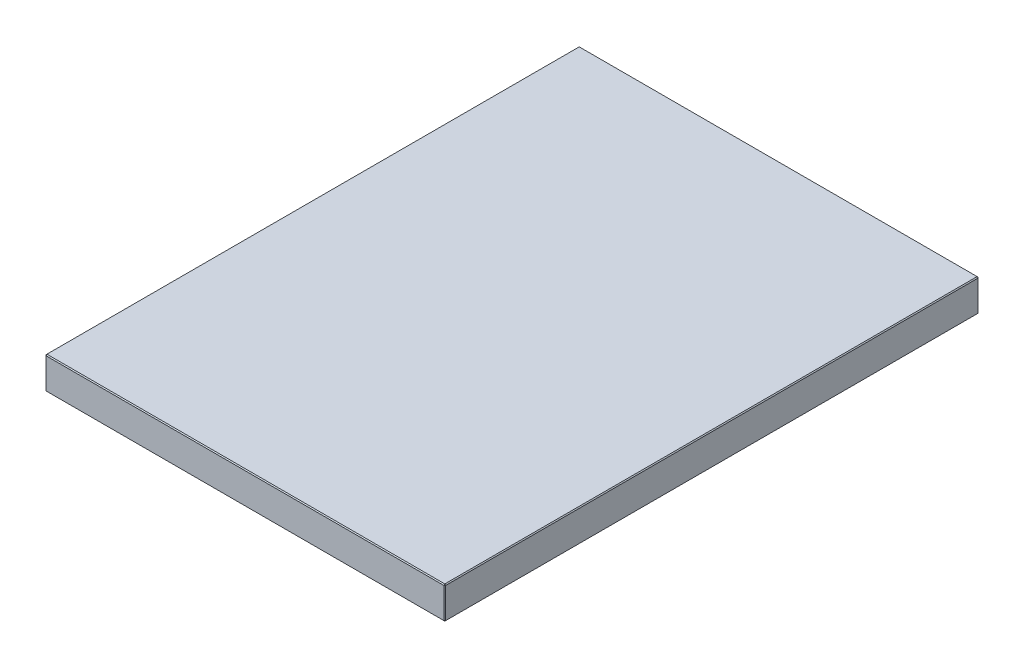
ISO-10303-21;
HEADER;
FILE_DESCRIPTION(('STEP AP214'),'2;1');
FILE_NAME('part.step','',(''),(''),'','','');
FILE_SCHEMA(('AUTOMOTIVE_DESIGN { 1 0 10303 214 1 1 1 1 }'));
ENDSEC;
DATA;
#1=APPLICATION_CONTEXT('core data for automotive mechanical design processes');
#2=APPLICATION_PROTOCOL_DEFINITION('international standard','automotive_design',2000,#1);
#3=PRODUCT_CONTEXT('',#1,'mechanical');
#4=PRODUCT('Part','Part','',(#3));
#5=PRODUCT_RELATED_PRODUCT_CATEGORY('part','',(#4));
#6=PRODUCT_DEFINITION_FORMATION('','',#4);
#7=PRODUCT_DEFINITION_CONTEXT('part definition',#1,'design');
#8=PRODUCT_DEFINITION('design','',#6,#7);
#9=PRODUCT_DEFINITION_SHAPE('','',#8);
#10=(LENGTH_UNIT() NAMED_UNIT(*) SI_UNIT(.MILLI.,.METRE.));
#11=(NAMED_UNIT(*) PLANE_ANGLE_UNIT() SI_UNIT($,.RADIAN.));
#12=(NAMED_UNIT(*) SI_UNIT($,.STERADIAN.) SOLID_ANGLE_UNIT());
#13=UNCERTAINTY_MEASURE_WITH_UNIT(LENGTH_MEASURE(1.E-05),#10,'distance_accuracy_value','');
#14=(GEOMETRIC_REPRESENTATION_CONTEXT(3) GLOBAL_UNCERTAINTY_ASSIGNED_CONTEXT((#13)) GLOBAL_UNIT_ASSIGNED_CONTEXT((#10,
#11,#12)) REPRESENTATION_CONTEXT('',''));
#15=CARTESIAN_POINT('',(0.,0.,0.));
#16=DIRECTION('',(0.,0.,1.));
#17=DIRECTION('',(1.,0.,0.));
#18=AXIS2_PLACEMENT_3D('',#15,#16,#17);
#19=CARTESIAN_POINT('',(223.,36.,298.));
#20=DIRECTION('',(-1.,0.,0.));
#21=DIRECTION('',(0.,0.,1.));
#22=AXIS2_PLACEMENT_3D('',#19,#20,#21);
#23=PLANE('',#22);
#24=DIRECTION('',(0.,0.,-1.));
#25=VECTOR('',#24,1.);
#26=CARTESIAN_POINT('',(223.,1.00000000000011,-298.));
#27=LINE('',#26,#25);
#28=CARTESIAN_POINT('',(223.,1.00000000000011,297.));
#29=VERTEX_POINT('',#28);
#30=CARTESIAN_POINT('',(223.,1.00000000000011,-297.));
#31=VERTEX_POINT('',#30);
#32=EDGE_CURVE('E151',#29,#31,#27,.T.);
#33=ORIENTED_EDGE('',*,*,#32,.T.);
#34=DIRECTION('',(0.,1.,0.));
#35=VECTOR('',#34,1.);
#36=CARTESIAN_POINT('',(223.,36.,-297.));
#37=LINE('',#36,#35);
#38=CARTESIAN_POINT('',(223.,35.,-297.));
#39=VERTEX_POINT('',#38);
#40=EDGE_CURVE('E153',#31,#39,#37,.T.);
#41=ORIENTED_EDGE('',*,*,#40,.T.);
#42=DIRECTION('',(0.,0.,1.));
#43=VECTOR('',#42,1.);
#44=CARTESIAN_POINT('',(223.,35.,298.));
#45=LINE('',#44,#43);
#46=CARTESIAN_POINT('',(223.,35.,297.));
#47=VERTEX_POINT('',#46);
#48=EDGE_CURVE('E147',#39,#47,#45,.T.);
#49=ORIENTED_EDGE('',*,*,#48,.T.);
#50=DIRECTION('',(0.,-1.,0.));
#51=VECTOR('',#50,1.);
#52=CARTESIAN_POINT('',(223.,36.,297.));
#53=LINE('',#52,#51);
#54=EDGE_CURVE('E149',#47,#29,#53,.T.);
#55=ORIENTED_EDGE('',*,*,#54,.T.);
#56=EDGE_LOOP('',(#33,#41,#49,#55));
#57=FACE_BOUND('',#56,.T.);
#58=ADVANCED_FACE('F16',(#57),#23,.F.);
#59=CARTESIAN_POINT('',(-223.,36.,-298.));
#60=DIRECTION('',(0.,0.,1.));
#61=DIRECTION('',(1.,0.,0.));
#62=AXIS2_PLACEMENT_3D('',#59,#60,#61);
#63=PLANE('',#62);
#64=DIRECTION('',(0.,-1.,0.));
#65=VECTOR('',#64,1.);
#66=CARTESIAN_POINT('',(222.,36.,-298.));
#67=LINE('',#66,#65);
#68=CARTESIAN_POINT('',(222.,35.,-298.));
#69=VERTEX_POINT('',#68);
#70=CARTESIAN_POINT('',(222.,1.,-298.));
#71=VERTEX_POINT('',#70);
#72=EDGE_CURVE('E115',#69,#71,#67,.T.);
#73=ORIENTED_EDGE('',*,*,#72,.T.);
#74=DIRECTION('',(-1.,0.,0.));
#75=VECTOR('',#74,1.);
#76=CARTESIAN_POINT('',(-223.,1.,-298.));
#77=LINE('',#76,#75);
#78=CARTESIAN_POINT('',(-222.,1.,-298.));
#79=VERTEX_POINT('',#78);
#80=EDGE_CURVE('E111',#71,#79,#77,.T.);
#81=ORIENTED_EDGE('',*,*,#80,.T.);
#82=DIRECTION('',(0.,1.,0.));
#83=VECTOR('',#82,1.);
#84=CARTESIAN_POINT('',(-222.,36.,-298.));
#85=LINE('',#84,#83);
#86=CARTESIAN_POINT('',(-222.,35.,-298.));
#87=VERTEX_POINT('',#86);
#88=EDGE_CURVE('E103',#79,#87,#85,.T.);
#89=ORIENTED_EDGE('',*,*,#88,.T.);
#90=DIRECTION('',(1.,0.,0.));
#91=VECTOR('',#90,1.);
#92=CARTESIAN_POINT('',(-223.,35.,-298.));
#93=LINE('',#92,#91);
#94=EDGE_CURVE('E108',#87,#69,#93,.T.);
#95=ORIENTED_EDGE('',*,*,#94,.T.);
#96=EDGE_LOOP('',(#73,#81,#89,#95));
#97=FACE_BOUND('',#96,.T.);
#98=ADVANCED_FACE('F106',(#97),#63,.F.);
#99=CARTESIAN_POINT('',(-223.,36.,298.));
#100=DIRECTION('',(1.,0.,0.));
#101=DIRECTION('',(0.,0.,-1.));
#102=AXIS2_PLACEMENT_3D('',#99,#100,#101);
#103=PLANE('',#102);
#104=DIRECTION('',(0.,-1.,0.));
#105=VECTOR('',#104,1.);
#106=CARTESIAN_POINT('',(-223.,36.,-297.));
#107=LINE('',#106,#105);
#108=CARTESIAN_POINT('',(-223.,35.,-297.));
#109=VERTEX_POINT('',#108);
#110=CARTESIAN_POINT('',(-223.,1.,-297.));
#111=VERTEX_POINT('',#110);
#112=EDGE_CURVE('E123',#109,#111,#107,.T.);
#113=ORIENTED_EDGE('',*,*,#112,.T.);
#114=DIRECTION('',(0.,0.,1.));
#115=VECTOR('',#114,1.);
#116=CARTESIAN_POINT('',(-223.,1.,298.));
#117=LINE('',#116,#115);
#118=CARTESIAN_POINT('',(-223.,1.,297.));
#119=VERTEX_POINT('',#118);
#120=EDGE_CURVE('E161',#111,#119,#117,.T.);
#121=ORIENTED_EDGE('',*,*,#120,.T.);
#122=DIRECTION('',(0.,1.,0.));
#123=VECTOR('',#122,1.);
#124=CARTESIAN_POINT('',(-223.,36.,297.));
#125=LINE('',#124,#123);
#126=CARTESIAN_POINT('',(-223.,35.,297.));
#127=VERTEX_POINT('',#126);
#128=EDGE_CURVE('E158',#119,#127,#125,.T.);
#129=ORIENTED_EDGE('',*,*,#128,.T.);
#130=DIRECTION('',(0.,0.,-1.));
#131=VECTOR('',#130,1.);
#132=CARTESIAN_POINT('',(-223.,35.,298.));
#133=LINE('',#132,#131);
#134=EDGE_CURVE('E156',#127,#109,#133,.T.);
#135=ORIENTED_EDGE('',*,*,#134,.T.);
#136=EDGE_LOOP('',(#113,#121,#129,#135));
#137=FACE_BOUND('',#136,.T.);
#138=ADVANCED_FACE('F310',(#137),#103,.F.);
#139=CARTESIAN_POINT('',(-223.,36.,298.));
#140=DIRECTION('',(0.,0.,-1.));
#141=DIRECTION('',(-1.,0.,0.));
#142=AXIS2_PLACEMENT_3D('',#139,#140,#141);
#143=PLANE('',#142);
#144=DIRECTION('',(-1.,0.,0.));
#145=VECTOR('',#144,1.);
#146=CARTESIAN_POINT('',(-223.,35.,298.));
#147=LINE('',#146,#145);
#148=CARTESIAN_POINT('',(222.,35.,298.));
#149=VERTEX_POINT('',#148);
#150=CARTESIAN_POINT('',(-222.,35.,298.));
#151=VERTEX_POINT('',#150);
#152=EDGE_CURVE('E163',#149,#151,#147,.T.);
#153=ORIENTED_EDGE('',*,*,#152,.T.);
#154=DIRECTION('',(0.,-1.,0.));
#155=VECTOR('',#154,1.);
#156=CARTESIAN_POINT('',(-222.,36.,298.));
#157=LINE('',#156,#155);
#158=CARTESIAN_POINT('',(-222.,1.,298.));
#159=VERTEX_POINT('',#158);
#160=EDGE_CURVE('E169',#151,#159,#157,.T.);
#161=ORIENTED_EDGE('',*,*,#160,.T.);
#162=DIRECTION('',(1.,0.,0.));
#163=VECTOR('',#162,1.);
#164=CARTESIAN_POINT('',(223.,1.,298.));
#165=LINE('',#164,#163);
#166=CARTESIAN_POINT('',(222.,1.,298.));
#167=VERTEX_POINT('',#166);
#168=EDGE_CURVE('E167',#159,#167,#165,.T.);
#169=ORIENTED_EDGE('',*,*,#168,.T.);
#170=DIRECTION('',(0.,1.,0.));
#171=VECTOR('',#170,1.);
#172=CARTESIAN_POINT('',(222.,36.,298.));
#173=LINE('',#172,#171);
#174=EDGE_CURVE('E165',#167,#149,#173,.T.);
#175=ORIENTED_EDGE('',*,*,#174,.T.);
#176=EDGE_LOOP('',(#153,#161,#169,#175));
#177=FACE_BOUND('',#176,.T.);
#178=ADVANCED_FACE('F256',(#177),#143,.F.);
#179=CARTESIAN_POINT('',(0.,36.,0.));
#180=DIRECTION('',(0.,-1.,0.));
#181=DIRECTION('',(0.,0.,-1.));
#182=AXIS2_PLACEMENT_3D('',#179,#180,#181);
#183=PLANE('',#182);
#184=DIRECTION('',(0.,0.,1.));
#185=VECTOR('',#184,1.);
#186=CARTESIAN_POINT('',(-222.,36.,0.));
#187=LINE('',#186,#185);
#188=CARTESIAN_POINT('',(-222.,36.,-297.));
#189=VERTEX_POINT('',#188);
#190=CARTESIAN_POINT('',(-222.,36.,297.));
#191=VERTEX_POINT('',#190);
#192=EDGE_CURVE('E25',#189,#191,#187,.T.);
#193=ORIENTED_EDGE('',*,*,#192,.T.);
#194=DIRECTION('',(1.,0.,0.));
#195=VECTOR('',#194,1.);
#196=CARTESIAN_POINT('',(0.,36.,297.));
#197=LINE('',#196,#195);
#198=CARTESIAN_POINT('',(222.,36.,297.));
#199=VERTEX_POINT('',#198);
#200=EDGE_CURVE('E10',#191,#199,#197,.T.);
#201=ORIENTED_EDGE('',*,*,#200,.T.);
#202=DIRECTION('',(0.,0.,-1.));
#203=VECTOR('',#202,1.);
#204=CARTESIAN_POINT('',(222.,36.,0.));
#205=LINE('',#204,#203);
#206=CARTESIAN_POINT('',(222.,36.,-297.));
#207=VERTEX_POINT('',#206);
#208=EDGE_CURVE('E181',#199,#207,#205,.T.);
#209=ORIENTED_EDGE('',*,*,#208,.T.);
#210=DIRECTION('',(-1.,0.,0.));
#211=VECTOR('',#210,1.);
#212=CARTESIAN_POINT('',(0.,36.,-297.));
#213=LINE('',#212,#211);
#214=EDGE_CURVE('E36',#207,#189,#213,.T.);
#215=ORIENTED_EDGE('',*,*,#214,.T.);
#216=EDGE_LOOP('',(#193,#201,#209,#215));
#217=FACE_BOUND('',#216,.T.);
#218=ADVANCED_FACE('F271',(#217),#183,.F.);
#219=CARTESIAN_POINT('',(0.,0.,0.));
#220=DIRECTION('',(0.,-1.,0.));
#221=DIRECTION('',(0.,0.,-1.));
#222=AXIS2_PLACEMENT_3D('',#219,#220,#221);
#223=PLANE('',#222);
#224=DIRECTION('',(0.,0.,-1.));
#225=VECTOR('',#224,1.);
#226=CARTESIAN_POINT('',(-222.,0.,-298.));
#227=LINE('',#226,#225);
#228=CARTESIAN_POINT('',(-222.,0.,297.));
#229=VERTEX_POINT('',#228);
#230=CARTESIAN_POINT('',(-222.,0.,-297.));
#231=VERTEX_POINT('',#230);
#232=EDGE_CURVE('E176',#229,#231,#227,.T.);
#233=ORIENTED_EDGE('',*,*,#232,.T.);
#234=DIRECTION('',(1.,0.,0.));
#235=VECTOR('',#234,1.);
#236=CARTESIAN_POINT('',(223.,0.,-297.));
#237=LINE('',#236,#235);
#238=CARTESIAN_POINT('',(222.,0.,-297.));
#239=VERTEX_POINT('',#238);
#240=EDGE_CURVE('E178',#231,#239,#237,.T.);
#241=ORIENTED_EDGE('',*,*,#240,.T.);
#242=DIRECTION('',(0.,0.,1.));
#243=VECTOR('',#242,1.);
#244=CARTESIAN_POINT('',(222.,0.,298.));
#245=LINE('',#244,#243);
#246=CARTESIAN_POINT('',(222.,0.,297.));
#247=VERTEX_POINT('',#246);
#248=EDGE_CURVE('E172',#239,#247,#245,.T.);
#249=ORIENTED_EDGE('',*,*,#248,.T.);
#250=DIRECTION('',(-1.,0.,0.));
#251=VECTOR('',#250,1.);
#252=CARTESIAN_POINT('',(-223.,0.,297.));
#253=LINE('',#252,#251);
#254=EDGE_CURVE('E174',#247,#229,#253,.T.);
#255=ORIENTED_EDGE('',*,*,#254,.T.);
#256=EDGE_LOOP('',(#233,#241,#249,#255));
#257=FACE_BOUND('',#256,.T.);
#258=ADVANCED_FACE('F247',(#257),#223,.T.);
#259=CARTESIAN_POINT('',(-222.,36.,298.));
#260=DIRECTION('',(0.707106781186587,0.,-0.707106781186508));
#261=DIRECTION('',(0.,-1.,0.));
#262=AXIS2_PLACEMENT_3D('',#259,#260,#261);
#263=PLANE('',#262);
#264=DIRECTION('',(-0.707106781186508,0.,-0.707106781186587));
#265=VECTOR('',#264,1.);
#266=CARTESIAN_POINT('',(-223.,35.,297.));
#267=LINE('',#266,#265);
#268=EDGE_CURVE('E20',#127,#151,#267,.F.);
#269=ORIENTED_EDGE('',*,*,#268,.F.);
#270=ORIENTED_EDGE('',*,*,#128,.F.);
#271=DIRECTION('',(0.707106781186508,0.,0.707106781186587));
#272=VECTOR('',#271,1.);
#273=CARTESIAN_POINT('',(-222.,1.,298.));
#274=LINE('',#273,#272);
#275=EDGE_CURVE('E143',#159,#119,#274,.F.);
#276=ORIENTED_EDGE('',*,*,#275,.F.);
#277=ORIENTED_EDGE('',*,*,#160,.F.);
#278=EDGE_LOOP('',(#269,#270,#276,#277));
#279=FACE_BOUND('',#278,.T.);
#280=ADVANCED_FACE('F18',(#279),#263,.F.);
#281=CARTESIAN_POINT('',(-223.,35.,297.));
#282=DIRECTION('',(-0.57735026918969,0.577350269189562,0.577350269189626));
#283=DIRECTION('',(0.707106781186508,0.,0.707106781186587));
#284=AXIS2_PLACEMENT_3D('',#281,#282,#283);
#285=PLANE('',#284);
#286=DIRECTION('',(0.707106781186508,0.707106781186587,0.));
#287=VECTOR('',#286,1.);
#288=CARTESIAN_POINT('',(-223.,35.,297.));
#289=LINE('',#288,#287);
#290=EDGE_CURVE('E227',#127,#191,#289,.T.);
#291=ORIENTED_EDGE('',*,*,#290,.F.);
#292=ORIENTED_EDGE('',*,*,#268,.T.);
#293=DIRECTION('',(0.,-0.707106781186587,0.707106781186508));
#294=VECTOR('',#293,1.);
#295=CARTESIAN_POINT('',(-222.,35.5,297.5));
#296=LINE('',#295,#294);
#297=EDGE_CURVE('E229',#191,#151,#296,.T.);
#298=ORIENTED_EDGE('',*,*,#297,.F.);
#299=EDGE_LOOP('',(#291,#292,#298));
#300=FACE_BOUND('',#299,.T.);
#301=ADVANCED_FACE('F460',(#300),#285,.T.);
#302=CARTESIAN_POINT('',(-222.,1.,298.));
#303=DIRECTION('',(-0.577350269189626,-0.57735026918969,0.577350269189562));
#304=DIRECTION('',(0.707106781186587,-0.707106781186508,0.));
#305=AXIS2_PLACEMENT_3D('',#302,#303,#304);
#306=PLANE('',#305);
#307=DIRECTION('',(0.,0.707106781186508,0.707106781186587));
#308=VECTOR('',#307,1.);
#309=CARTESIAN_POINT('',(-222.,1.,298.));
#310=LINE('',#309,#308);
#311=EDGE_CURVE('E221',#159,#229,#310,.F.);
#312=ORIENTED_EDGE('',*,*,#311,.F.);
#313=ORIENTED_EDGE('',*,*,#275,.T.);
#314=DIRECTION('',(0.707106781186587,-0.707106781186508,0.));
#315=VECTOR('',#314,1.);
#316=CARTESIAN_POINT('',(-222.5,0.5,297.));
#317=LINE('',#316,#315);
#318=EDGE_CURVE('E224',#229,#119,#317,.F.);
#319=ORIENTED_EDGE('',*,*,#318,.F.);
#320=EDGE_LOOP('',(#312,#313,#319));
#321=FACE_BOUND('',#320,.T.);
#322=ADVANCED_FACE('F236',(#321),#306,.T.);
#323=CARTESIAN_POINT('',(0.,36.,297.));
#324=DIRECTION('',(0.,-0.707106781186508,-0.707106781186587));
#325=DIRECTION('',(1.,0.,0.));
#326=AXIS2_PLACEMENT_3D('',#323,#324,#325);
#327=PLANE('',#326);
#328=ORIENTED_EDGE('',*,*,#297,.T.);
#329=ORIENTED_EDGE('',*,*,#152,.F.);
#330=DIRECTION('',(0.,0.707106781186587,-0.707106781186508));
#331=VECTOR('',#330,1.);
#332=CARTESIAN_POINT('',(222.,35.,298.));
#333=LINE('',#332,#331);
#334=EDGE_CURVE('E215',#199,#149,#333,.F.);
#335=ORIENTED_EDGE('',*,*,#334,.F.);
#336=ORIENTED_EDGE('',*,*,#200,.F.);
#337=EDGE_LOOP('',(#328,#329,#335,#336));
#338=FACE_BOUND('',#337,.T.);
#339=ADVANCED_FACE('F270',(#338),#327,.F.);
#340=CARTESIAN_POINT('',(-222.,36.,0.));
#341=DIRECTION('',(0.707106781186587,-0.707106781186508,0.));
#342=DIRECTION('',(0.,0.,1.));
#343=AXIS2_PLACEMENT_3D('',#340,#341,#342);
#344=PLANE('',#343);
#345=ORIENTED_EDGE('',*,*,#290,.T.);
#346=ORIENTED_EDGE('',*,*,#192,.F.);
#347=DIRECTION('',(-0.707106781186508,-0.707106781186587,0.));
#348=VECTOR('',#347,1.);
#349=CARTESIAN_POINT('',(-222.5,35.5,-297.));
#350=LINE('',#349,#348);
#351=EDGE_CURVE('E127',#109,#189,#350,.F.);
#352=ORIENTED_EDGE('',*,*,#351,.F.);
#353=ORIENTED_EDGE('',*,*,#134,.F.);
#354=EDGE_LOOP('',(#345,#346,#352,#353));
#355=FACE_BOUND('',#354,.T.);
#356=ADVANCED_FACE('F437',(#355),#344,.F.);
#357=CARTESIAN_POINT('',(-223.,36.,-297.));
#358=DIRECTION('',(0.707106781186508,0.,0.707106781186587));
#359=DIRECTION('',(0.,-1.,0.));
#360=AXIS2_PLACEMENT_3D('',#357,#358,#359);
#361=PLANE('',#360);
#362=DIRECTION('',(-0.707106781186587,0.,0.707106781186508));
#363=VECTOR('',#362,1.);
#364=CARTESIAN_POINT('',(-223.,1.,-297.));
#365=LINE('',#364,#363);
#366=EDGE_CURVE('E128',#111,#79,#365,.F.);
#367=ORIENTED_EDGE('',*,*,#366,.F.);
#368=ORIENTED_EDGE('',*,*,#112,.F.);
#369=DIRECTION('',(0.707106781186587,0.,-0.707106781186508));
#370=VECTOR('',#369,1.);
#371=CARTESIAN_POINT('',(-222.,35.,-298.));
#372=LINE('',#371,#370);
#373=EDGE_CURVE('E119',#87,#109,#372,.F.);
#374=ORIENTED_EDGE('',*,*,#373,.F.);
#375=ORIENTED_EDGE('',*,*,#88,.F.);
#376=EDGE_LOOP('',(#367,#368,#374,#375));
#377=FACE_BOUND('',#376,.T.);
#378=ADVANCED_FACE('F121',(#377),#361,.F.);
#379=CARTESIAN_POINT('',(-223.,1.,298.));
#380=DIRECTION('',(-0.707106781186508,-0.707106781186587,0.));
#381=DIRECTION('',(0.,0.,-1.));
#382=AXIS2_PLACEMENT_3D('',#379,#380,#381);
#383=PLANE('',#382);
#384=ORIENTED_EDGE('',*,*,#318,.T.);
#385=ORIENTED_EDGE('',*,*,#120,.F.);
#386=DIRECTION('',(-0.707106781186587,0.707106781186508,0.));
#387=VECTOR('',#386,1.);
#388=CARTESIAN_POINT('',(-223.,1.,-297.));
#389=LINE('',#388,#387);
#390=EDGE_CURVE('E211',#231,#111,#389,.T.);
#391=ORIENTED_EDGE('',*,*,#390,.F.);
#392=ORIENTED_EDGE('',*,*,#232,.F.);
#393=EDGE_LOOP('',(#384,#385,#391,#392));
#394=FACE_BOUND('',#393,.T.);
#395=ADVANCED_FACE('F243',(#394),#383,.T.);
#396=CARTESIAN_POINT('',(-223.,1.,298.));
#397=DIRECTION('',(0.,-0.707106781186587,0.707106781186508));
#398=DIRECTION('',(-1.,0.,0.));
#399=AXIS2_PLACEMENT_3D('',#396,#397,#398);
#400=PLANE('',#399);
#401=ORIENTED_EDGE('',*,*,#311,.T.);
#402=ORIENTED_EDGE('',*,*,#254,.F.);
#403=DIRECTION('',(0.,-0.707106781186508,-0.707106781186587));
#404=VECTOR('',#403,1.);
#405=CARTESIAN_POINT('',(222.,1.,298.));
#406=LINE('',#405,#404);
#407=EDGE_CURVE('E208',#167,#247,#406,.T.);
#408=ORIENTED_EDGE('',*,*,#407,.F.);
#409=ORIENTED_EDGE('',*,*,#168,.F.);
#410=EDGE_LOOP('',(#401,#402,#408,#409));
#411=FACE_BOUND('',#410,.T.);
#412=ADVANCED_FACE('F253',(#411),#400,.T.);
#413=CARTESIAN_POINT('',(223.,36.,297.));
#414=DIRECTION('',(-0.707106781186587,0.,-0.707106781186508));
#415=DIRECTION('',(0.,-1.,0.));
#416=AXIS2_PLACEMENT_3D('',#413,#414,#415);
#417=PLANE('',#416);
#418=DIRECTION('',(-0.707106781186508,0.,0.707106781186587));
#419=VECTOR('',#418,1.);
#420=CARTESIAN_POINT('',(222.,35.,298.));
#421=LINE('',#420,#419);
#422=EDGE_CURVE('E218',#149,#47,#421,.F.);
#423=ORIENTED_EDGE('',*,*,#422,.F.);
#424=ORIENTED_EDGE('',*,*,#174,.F.);
#425=DIRECTION('',(0.707106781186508,0.,-0.707106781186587));
#426=VECTOR('',#425,1.);
#427=CARTESIAN_POINT('',(222.,1.,298.));
#428=LINE('',#427,#426);
#429=EDGE_CURVE('E205',#29,#167,#428,.F.);
#430=ORIENTED_EDGE('',*,*,#429,.F.);
#431=ORIENTED_EDGE('',*,*,#54,.F.);
#432=EDGE_LOOP('',(#423,#424,#430,#431));
#433=FACE_BOUND('',#432,.T.);
#434=ADVANCED_FACE('F261',(#433),#417,.F.);
#435=CARTESIAN_POINT('',(222.,35.,298.));
#436=DIRECTION('',(0.57735026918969,0.577350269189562,0.577350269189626));
#437=DIRECTION('',(0.707106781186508,0.,-0.707106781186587));
#438=AXIS2_PLACEMENT_3D('',#435,#436,#437);
#439=PLANE('',#438);
#440=ORIENTED_EDGE('',*,*,#334,.T.);
#441=ORIENTED_EDGE('',*,*,#422,.T.);
#442=DIRECTION('',(0.707106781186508,-0.707106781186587,0.));
#443=VECTOR('',#442,1.);
#444=CARTESIAN_POINT('',(222.5,35.5,297.));
#445=LINE('',#444,#443);
#446=EDGE_CURVE('E134',#199,#47,#445,.T.);
#447=ORIENTED_EDGE('',*,*,#446,.F.);
#448=EDGE_LOOP('',(#440,#441,#447));
#449=FACE_BOUND('',#448,.T.);
#450=ADVANCED_FACE('F267',(#449),#439,.T.);
#451=CARTESIAN_POINT('',(-222.,35.,-298.));
#452=DIRECTION('',(-0.577350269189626,0.577350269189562,-0.57735026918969));
#453=DIRECTION('',(-0.707106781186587,0.,0.707106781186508));
#454=AXIS2_PLACEMENT_3D('',#451,#452,#453);
#455=PLANE('',#454);
#456=ORIENTED_EDGE('',*,*,#373,.T.);
#457=ORIENTED_EDGE('',*,*,#351,.T.);
#458=DIRECTION('',(0.,0.707106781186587,0.707106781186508));
#459=VECTOR('',#458,1.);
#460=CARTESIAN_POINT('',(-222.,35.,-298.));
#461=LINE('',#460,#459);
#462=EDGE_CURVE('E131',#87,#189,#461,.T.);
#463=ORIENTED_EDGE('',*,*,#462,.F.);
#464=EDGE_LOOP('',(#456,#457,#463));
#465=FACE_BOUND('',#464,.T.);
#466=ADVANCED_FACE('F132',(#465),#455,.T.);
#467=CARTESIAN_POINT('',(-223.,1.,-297.));
#468=DIRECTION('',(-0.577350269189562,-0.57735026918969,-0.577350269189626));
#469=DIRECTION('',(0.,0.707106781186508,-0.707106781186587));
#470=AXIS2_PLACEMENT_3D('',#467,#468,#469);
#471=PLANE('',#470);
#472=ORIENTED_EDGE('',*,*,#390,.T.);
#473=ORIENTED_EDGE('',*,*,#366,.T.);
#474=DIRECTION('',(0.,-0.707106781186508,0.707106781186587));
#475=VECTOR('',#474,1.);
#476=CARTESIAN_POINT('',(-222.,0.5,-297.5));
#477=LINE('',#476,#475);
#478=EDGE_CURVE('E135',#231,#79,#477,.F.);
#479=ORIENTED_EDGE('',*,*,#478,.F.);
#480=EDGE_LOOP('',(#472,#473,#479));
#481=FACE_BOUND('',#480,.T.);
#482=ADVANCED_FACE('F290',(#481),#471,.T.);
#483=CARTESIAN_POINT('',(222.,1.,298.));
#484=DIRECTION('',(0.57735026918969,-0.577350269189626,0.577350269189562));
#485=DIRECTION('',(0.707106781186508,0.707106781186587,0.));
#486=AXIS2_PLACEMENT_3D('',#483,#484,#485);
#487=PLANE('',#486);
#488=ORIENTED_EDGE('',*,*,#429,.T.);
#489=ORIENTED_EDGE('',*,*,#407,.T.);
#490=DIRECTION('',(0.707106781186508,0.707106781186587,0.));
#491=VECTOR('',#490,1.);
#492=CARTESIAN_POINT('',(222.5,0.500000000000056,297.));
#493=LINE('',#492,#491);
#494=EDGE_CURVE('E198',#29,#247,#493,.F.);
#495=ORIENTED_EDGE('',*,*,#494,.F.);
#496=EDGE_LOOP('',(#488,#489,#495));
#497=FACE_BOUND('',#496,.T.);
#498=ADVANCED_FACE('F292',(#497),#487,.T.);
#499=CARTESIAN_POINT('',(222.,36.,0.));
#500=DIRECTION('',(-0.707106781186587,-0.707106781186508,0.));
#501=DIRECTION('',(0.,0.,-1.));
#502=AXIS2_PLACEMENT_3D('',#499,#500,#501);
#503=PLANE('',#502);
#504=ORIENTED_EDGE('',*,*,#446,.T.);
#505=ORIENTED_EDGE('',*,*,#48,.F.);
#506=DIRECTION('',(-0.707106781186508,0.707106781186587,0.));
#507=VECTOR('',#506,1.);
#508=CARTESIAN_POINT('',(223.,35.,-297.));
#509=LINE('',#508,#507);
#510=EDGE_CURVE('E195',#207,#39,#509,.F.);
#511=ORIENTED_EDGE('',*,*,#510,.F.);
#512=ORIENTED_EDGE('',*,*,#208,.F.);
#513=EDGE_LOOP('',(#504,#505,#511,#512));
#514=FACE_BOUND('',#513,.T.);
#515=ADVANCED_FACE('F275',(#514),#503,.F.);
#516=CARTESIAN_POINT('',(0.,36.,-297.));
#517=DIRECTION('',(0.,-0.707106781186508,0.707106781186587));
#518=DIRECTION('',(-1.,0.,0.));
#519=AXIS2_PLACEMENT_3D('',#516,#517,#518);
#520=PLANE('',#519);
#521=ORIENTED_EDGE('',*,*,#462,.T.);
#522=ORIENTED_EDGE('',*,*,#214,.F.);
#523=DIRECTION('',(0.,-0.707106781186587,-0.707106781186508));
#524=VECTOR('',#523,1.);
#525=CARTESIAN_POINT('',(222.,35.5,-297.5));
#526=LINE('',#525,#524);
#527=EDGE_CURVE('E139',#69,#207,#526,.F.);
#528=ORIENTED_EDGE('',*,*,#527,.F.);
#529=ORIENTED_EDGE('',*,*,#94,.F.);
#530=EDGE_LOOP('',(#521,#522,#528,#529));
#531=FACE_BOUND('',#530,.T.);
#532=ADVANCED_FACE('F137',(#531),#520,.F.);
#533=CARTESIAN_POINT('',(-223.,1.,-298.));
#534=DIRECTION('',(0.,-0.707106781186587,-0.707106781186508));
#535=DIRECTION('',(1.,0.,0.));
#536=AXIS2_PLACEMENT_3D('',#533,#534,#535);
#537=PLANE('',#536);
#538=ORIENTED_EDGE('',*,*,#478,.T.);
#539=ORIENTED_EDGE('',*,*,#80,.F.);
#540=DIRECTION('',(0.,0.707106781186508,-0.707106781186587));
#541=VECTOR('',#540,1.);
#542=CARTESIAN_POINT('',(222.,1.,-298.));
#543=LINE('',#542,#541);
#544=EDGE_CURVE('E191',#239,#71,#543,.T.);
#545=ORIENTED_EDGE('',*,*,#544,.F.);
#546=ORIENTED_EDGE('',*,*,#240,.F.);
#547=EDGE_LOOP('',(#538,#539,#545,#546));
#548=FACE_BOUND('',#547,.T.);
#549=ADVANCED_FACE('F288',(#548),#537,.T.);
#550=CARTESIAN_POINT('',(223.,1.00000000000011,298.));
#551=DIRECTION('',(0.707106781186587,-0.707106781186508,0.));
#552=DIRECTION('',(0.,0.,1.));
#553=AXIS2_PLACEMENT_3D('',#550,#551,#552);
#554=PLANE('',#553);
#555=ORIENTED_EDGE('',*,*,#494,.T.);
#556=ORIENTED_EDGE('',*,*,#248,.F.);
#557=DIRECTION('',(-0.707106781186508,-0.707106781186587,0.));
#558=VECTOR('',#557,1.);
#559=CARTESIAN_POINT('',(222.5,0.500000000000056,-297.));
#560=LINE('',#559,#558);
#561=EDGE_CURVE('E189',#31,#239,#560,.T.);
#562=ORIENTED_EDGE('',*,*,#561,.F.);
#563=ORIENTED_EDGE('',*,*,#32,.F.);
#564=EDGE_LOOP('',(#555,#556,#562,#563));
#565=FACE_BOUND('',#564,.T.);
#566=ADVANCED_FACE('F320',(#565),#554,.T.);
#567=CARTESIAN_POINT('',(223.,35.,-297.));
#568=DIRECTION('',(0.57735026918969,0.577350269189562,-0.577350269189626));
#569=DIRECTION('',(-0.707106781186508,0.,-0.707106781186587));
#570=AXIS2_PLACEMENT_3D('',#567,#568,#569);
#571=PLANE('',#570);
#572=ORIENTED_EDGE('',*,*,#527,.T.);
#573=ORIENTED_EDGE('',*,*,#510,.T.);
#574=DIRECTION('',(0.707106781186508,0.,0.707106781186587));
#575=VECTOR('',#574,1.);
#576=CARTESIAN_POINT('',(223.,35.,-297.));
#577=LINE('',#576,#575);
#578=EDGE_CURVE('E187',#69,#39,#577,.T.);
#579=ORIENTED_EDGE('',*,*,#578,.F.);
#580=EDGE_LOOP('',(#572,#573,#579));
#581=FACE_BOUND('',#580,.T.);
#582=ADVANCED_FACE('F277',(#581),#571,.T.);
#583=CARTESIAN_POINT('',(222.,1.,-298.));
#584=DIRECTION('',(0.57735026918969,-0.577350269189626,-0.577350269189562));
#585=DIRECTION('',(0.707106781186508,0.707106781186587,0.));
#586=AXIS2_PLACEMENT_3D('',#583,#584,#585);
#587=PLANE('',#586);
#588=ORIENTED_EDGE('',*,*,#561,.T.);
#589=ORIENTED_EDGE('',*,*,#544,.T.);
#590=DIRECTION('',(-0.707106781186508,0.,-0.707106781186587));
#591=VECTOR('',#590,1.);
#592=CARTESIAN_POINT('',(222.,1.,-298.));
#593=LINE('',#592,#591);
#594=EDGE_CURVE('E185',#31,#71,#593,.T.);
#595=ORIENTED_EDGE('',*,*,#594,.F.);
#596=EDGE_LOOP('',(#588,#589,#595));
#597=FACE_BOUND('',#596,.T.);
#598=ADVANCED_FACE('F285',(#597),#587,.T.);
#599=CARTESIAN_POINT('',(222.,36.,-298.));
#600=DIRECTION('',(-0.707106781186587,0.,0.707106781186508));
#601=DIRECTION('',(0.,-1.,0.));
#602=AXIS2_PLACEMENT_3D('',#599,#600,#601);
#603=PLANE('',#602);
#604=ORIENTED_EDGE('',*,*,#578,.T.);
#605=ORIENTED_EDGE('',*,*,#40,.F.);
#606=ORIENTED_EDGE('',*,*,#594,.T.);
#607=ORIENTED_EDGE('',*,*,#72,.F.);
#608=EDGE_LOOP('',(#604,#605,#606,#607));
#609=FACE_BOUND('',#608,.T.);
#610=ADVANCED_FACE('F281',(#609),#603,.F.);
#611=CLOSED_SHELL('',(#58,#98,#138,#178,#218,#258,#280,#301,#322,#339,#356,#378,#395,#412,#434,
#450,#466,#482,#498,#515,#532,#549,#566,#582,#598,#610));
#612=MANIFOLD_SOLID_BREP('B1',#611);
#613=ADVANCED_BREP_SHAPE_REPRESENTATION('',(#18,#612),#14);
#614=SHAPE_DEFINITION_REPRESENTATION(#9,#613);
ENDSEC;
END-ISO-10303-21;
